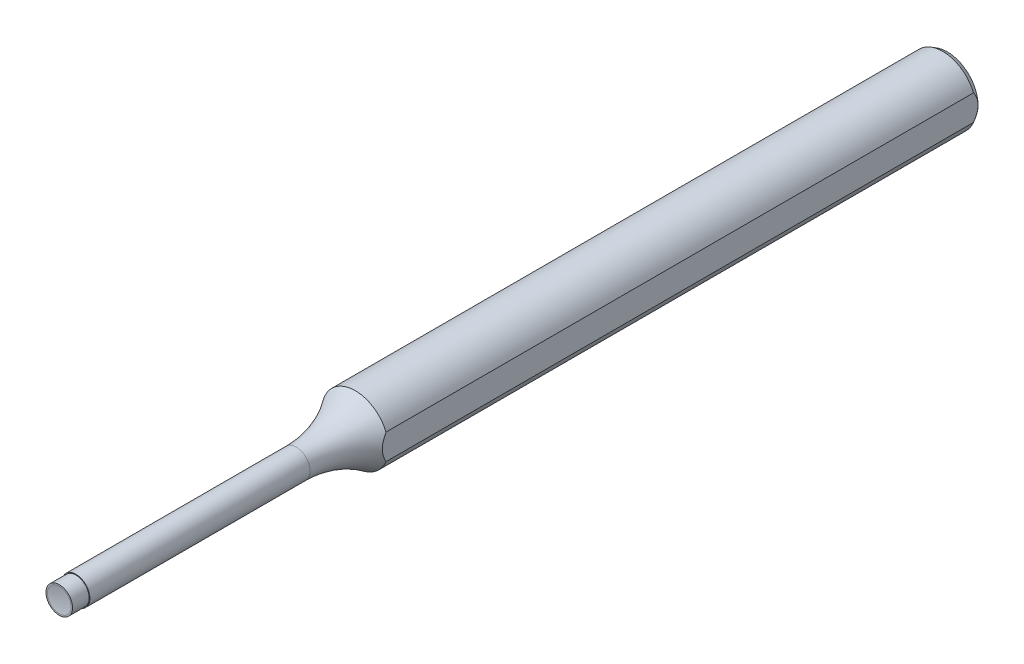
from build123d import *

# Parameters (mm, degrees)
SKETCH1_R           = 4.765
BOSS_EXTRUDE1_DEPTH = 127
SKETCH2_OUTSIDE_W   = 37.072
SKETCH2_OUTSIDE_H   = 37.072
SKETCH2_OUTSIDE_R   = 2
CUT_EXTRUDE1_DEPTH  = 42.333333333
SKETCH3_OUTSIDE_W   = 37.072
SKETCH3_OUTSIDE_H   = 37.072
SKETCH3_OUTSIDE_R   = 1.9
CUT_EXTRUDE2_DEPTH  = 2.3825
CHAMFER1_SIZE       = 0.635333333
CHAMFER1_SIZE2      = 0.366809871
SKETCH7_W           = 3.666687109
SKETCH7_H           = 3.66668711
CUT_EXTRUDE3_DEPTH  = 128.178655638


with BuildPart() as part:
    # Sketch1 → Boss-Extrude1 (new body)
    with BuildSketch(Plane.XY):
        Circle(SKETCH1_R)
    extrude(amount=-BOSS_EXTRUDE1_DEPTH)

    # Sketch2 outside → Cut-Extrude1 (cut)
    with BuildSketch(Plane.XY):
        Rectangle(SKETCH2_OUTSIDE_W, SKETCH2_OUTSIDE_H)
        Circle(SKETCH2_OUTSIDE_R, mode=Mode.SUBTRACT)
    extrude(amount=-CUT_EXTRUDE1_DEPTH, mode=Mode.SUBTRACT)

    # Sketch3 outside → Cut-Extrude2 (cut)
    with BuildSketch(Plane.XY):
        Rectangle(SKETCH3_OUTSIDE_W, SKETCH3_OUTSIDE_H)
        Circle(SKETCH3_OUTSIDE_R, mode=Mode.SUBTRACT)
    extrude(amount=-CUT_EXTRUDE2_DEPTH, mode=Mode.SUBTRACT)

    # Sketch4 → Cut-Revolve1 (revolve, cut)
    with BuildSketch(Plane(origin=(0, 0, 0), x_dir=(0, 0, -1), z_dir=(1, 0, 0))):
        with BuildLine():
            Line((0, 0), (0, 1.7))
            ThreePointArc((0, 1.7), (0.114562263, 0.853428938), (0.152852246, 0))
            Line((0.152852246, 0), (0, 0))
        make_face()
    revolve(axis=Axis((0, 0, 0), (0, 0, -1)), mode=Mode.SUBTRACT)

    # Chamfer1
    chamfer1_edges = [part.edges().sort_by_distance(p)[0] for p in [
        (-4.765, 0, -127),
    ]]
    chamfer1_side = [part.faces().sort_by_distance(p)[0] for p in [
        (-4.765, 0, -84.666666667),
    ]]
    chamfer(chamfer1_edges, length=CHAMFER1_SIZE, length2=CHAMFER1_SIZE2, reference=chamfer1_side[0])

    # Sketch5 → Revolve1 (revolve)
    with BuildSketch(Plane(origin=(0, 0, 0), x_dir=(0, 0, -1), z_dir=(1, 0, 0)), mode=Mode.PRIVATE) as revolve1_sk:
        with BuildLine():
            Line((42.333333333, 0), (33.883118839, 0))
            Line((33.883118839, 0), (33.883118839, 2))
            ThreePointArc((33.883118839, 2), (38.328660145, 2.708823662), (42.333333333, 4.765))
            Line((42.333333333, 4.765), (42.333333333, 0))
        make_face()
    revolve(revolve1_sk.sketch.rotate(Axis((0, 0, -42.333333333), (0, 0, 1)), 270), axis=Axis((0, 0, -42.333333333), (0, 0, 1)))

    # Sketch7 → Cut-Extrude3 (cut, through all)
    with BuildSketch(Plane(origin=(0, 0, -127), x_dir=(-1, 0, 0), z_dir=(0, 0, -1))):
        with Locations((-6.231533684, 0)):
            Rectangle(SKETCH7_W, SKETCH7_H)
    extrude(amount=-CUT_EXTRUDE3_DEPTH, mode=Mode.SUBTRACT)


solid = part.part
